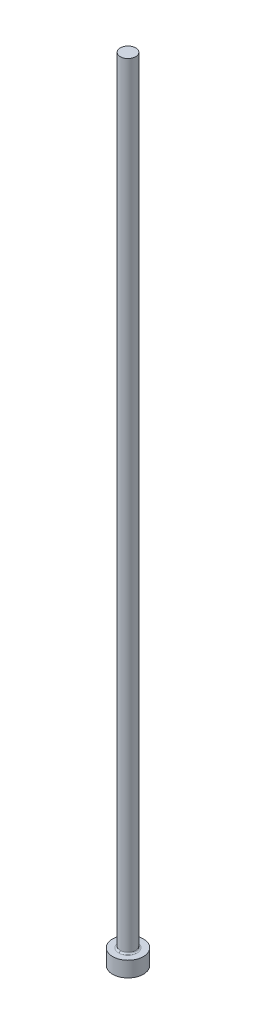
ISO-10303-21;
HEADER;
FILE_DESCRIPTION(('STEP AP214'),'2;1');
FILE_NAME('part.step','',(''),(''),'','','');
FILE_SCHEMA(('AUTOMOTIVE_DESIGN { 1 0 10303 214 1 1 1 1 }'));
ENDSEC;
DATA;
#1=APPLICATION_CONTEXT('core data for automotive mechanical design processes');
#2=APPLICATION_PROTOCOL_DEFINITION('international standard','automotive_design',2000,#1);
#3=PRODUCT_CONTEXT('',#1,'mechanical');
#4=PRODUCT('Part','Part','',(#3));
#5=PRODUCT_RELATED_PRODUCT_CATEGORY('part','',(#4));
#6=PRODUCT_DEFINITION_FORMATION('','',#4);
#7=PRODUCT_DEFINITION_CONTEXT('part definition',#1,'design');
#8=PRODUCT_DEFINITION('design','',#6,#7);
#9=PRODUCT_DEFINITION_SHAPE('','',#8);
#10=(LENGTH_UNIT() NAMED_UNIT(*) SI_UNIT(.MILLI.,.METRE.));
#11=(NAMED_UNIT(*) PLANE_ANGLE_UNIT() SI_UNIT($,.RADIAN.));
#12=(NAMED_UNIT(*) SI_UNIT($,.STERADIAN.) SOLID_ANGLE_UNIT());
#13=UNCERTAINTY_MEASURE_WITH_UNIT(LENGTH_MEASURE(1.E-05),#10,'distance_accuracy_value','');
#14=(GEOMETRIC_REPRESENTATION_CONTEXT(3) GLOBAL_UNCERTAINTY_ASSIGNED_CONTEXT((#13)) GLOBAL_UNIT_ASSIGNED_CONTEXT((#10,
#11,#12)) REPRESENTATION_CONTEXT('',''));
#15=CARTESIAN_POINT('',(0.,0.,0.));
#16=DIRECTION('',(0.,0.,1.));
#17=DIRECTION('',(1.,0.,0.));
#18=AXIS2_PLACEMENT_3D('',#15,#16,#17);
#19=CARTESIAN_POINT('',(-11.6785,-106.,107.776));
#20=DIRECTION('',(0.,-1.,0.));
#21=DIRECTION('',(0.,0.,1.));
#22=AXIS2_PLACEMENT_3D('',#19,#20,#21);
#23=PLANE('',#22);
#24=CARTESIAN_POINT('',(-13.7025,-106.,109.8));
#25=DIRECTION('',(0.,1.,0.));
#26=DIRECTION('',(-1.,0.,0.));
#27=AXIS2_PLACEMENT_3D('',#24,#25,#26);
#28=CIRCLE('',#27,2.);
#29=CARTESIAN_POINT('',(-15.7025,-106.,109.8));
#30=VERTEX_POINT('',#29);
#31=EDGE_CURVE('E45',#30,#30,#28,.F.);
#32=ORIENTED_EDGE('',*,*,#31,.T.);
#33=EDGE_LOOP('',(#32));
#34=FACE_BOUND('',#33,.T.);
#35=ADVANCED_FACE('F40',(#34),#23,.T.);
#36=CARTESIAN_POINT('',(-13.7025,-106.,109.8));
#37=DIRECTION('',(0.,1.,0.));
#38=DIRECTION('',(-1.,0.,0.));
#39=AXIS2_PLACEMENT_3D('',#36,#37,#38);
#40=CYLINDRICAL_SURFACE('',#39,2.);
#41=CARTESIAN_POINT('',(-13.7025,-104.,109.8));
#42=DIRECTION('',(0.,1.,0.));
#43=DIRECTION('',(-1.,0.,0.));
#44=AXIS2_PLACEMENT_3D('',#41,#42,#43);
#45=CIRCLE('',#44,2.);
#46=CARTESIAN_POINT('',(-15.7025,-104.,109.8));
#47=VERTEX_POINT('',#46);
#48=EDGE_CURVE('E81',#47,#47,#45,.T.);
#49=ORIENTED_EDGE('',*,*,#48,.F.);
#50=EDGE_LOOP('',(#49));
#51=FACE_BOUND('',#50,.T.);
#52=ORIENTED_EDGE('',*,*,#31,.F.);
#53=EDGE_LOOP('',(#52));
#54=FACE_BOUND('',#53,.T.);
#55=ADVANCED_FACE('F119',(#51,#54),#40,.T.);
#56=CARTESIAN_POINT('',(-13.7025,-103.999000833,108.580033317));
#57=CARTESIAN_POINT('',(-16.142433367,-103.999000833,108.580033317));
#58=CARTESIAN_POINT('',(-16.142433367,-103.999000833,111.019966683));
#59=CARTESIAN_POINT('',(-13.7025,-103.999000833,111.019966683));
#60=CARTESIAN_POINT('',(-13.7025,-104.012644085,108.716010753));
#61=CARTESIAN_POINT('',(-15.870478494,-104.012644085,108.716010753));
#62=CARTESIAN_POINT('',(-15.870478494,-104.012644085,110.883989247));
#63=CARTESIAN_POINT('',(-13.7025,-104.012644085,110.883989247));
#64=CARTESIAN_POINT('',(-13.7025,-103.916010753,108.812644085));
#65=CARTESIAN_POINT('',(-15.677211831,-103.916010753,108.812644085));
#66=CARTESIAN_POINT('',(-15.677211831,-103.916010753,110.787355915));
#67=CARTESIAN_POINT('',(-13.7025,-103.916010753,110.787355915));
#68=CARTESIAN_POINT('',(-13.7025,-103.780033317,108.799000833));
#69=CARTESIAN_POINT('',(-15.704498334,-103.780033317,108.799000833));
#70=CARTESIAN_POINT('',(-15.704498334,-103.780033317,110.800999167));
#71=CARTESIAN_POINT('',(-13.7025,-103.780033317,110.800999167));
#72=(BOUNDED_SURFACE() B_SPLINE_SURFACE(3,3,((#56,#57,#58,#59),(#60,#61,#62,#63),(#64,#65,#66,
#67),(#68,#69,#70,#71)),.UNSPECIFIED.,.F.,.F.,.F.) B_SPLINE_SURFACE_WITH_KNOTS((4,4),(4,4),(0.,
1.),(0.,1.),.UNSPECIFIED.) GEOMETRIC_REPRESENTATION_ITEM() RATIONAL_B_SPLINE_SURFACE(((1.,
0.333333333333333,0.333333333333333,1.),(0.755320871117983,0.251773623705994,0.251773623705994,
0.755320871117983),(0.755320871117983,0.251773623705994,0.251773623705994,0.755320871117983),
(1.,0.333333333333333,0.333333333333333,1.))) REPRESENTATION_ITEM('') SURFACE());
#73=CARTESIAN_POINT('',(-13.7025,-103.8,109.8));
#74=DIRECTION('',(0.,1.,0.));
#75=DIRECTION('',(0.,0.,-1.));
#76=AXIS2_PLACEMENT_3D('',#73,#74,#75);
#77=CIRCLE('',#76,1.);
#78=CARTESIAN_POINT('',(-13.7024999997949,-103.800000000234,110.799999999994));
#79=VERTEX_POINT('',#78);
#80=CARTESIAN_POINT('',(-13.7024999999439,-103.80000000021,108.800000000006));
#81=VERTEX_POINT('',#80);
#82=EDGE_CURVE('E75',#79,#81,#77,.F.);
#83=CARTESIAN_POINT('',(-13.7025,-103.999000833,108.580033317));
#84=CARTESIAN_POINT('',(-13.7025,-104.012644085,108.716010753));
#85=CARTESIAN_POINT('',(-13.7025,-103.916010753,108.812644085));
#86=CARTESIAN_POINT('',(-13.7025,-103.780033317,108.799000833));
#87=(BOUNDED_CURVE() B_SPLINE_CURVE(3,(#83,#84,#85,#86),.UNSPECIFIED.,.F.,
.F.) B_SPLINE_CURVE_WITH_KNOTS((4,4),(0.,1.),
.UNSPECIFIED.) CURVE() GEOMETRIC_REPRESENTATION_ITEM() RATIONAL_B_SPLINE_CURVE((1.,
0.755320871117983,0.755320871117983,1.)) REPRESENTATION_ITEM(''));
#88=CARTESIAN_POINT('',(-13.7025,-104.000000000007,108.599999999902));
#89=VERTEX_POINT('',#88);
#90=EDGE_CURVE('E69',#89,#81,#87,.T.);
#91=CARTESIAN_POINT('',(-13.7025,-104.000000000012,108.600000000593));
#92=CARTESIAN_POINT('',(-16.1024999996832,-104.000000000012,108.600000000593));
#93=CARTESIAN_POINT('',(-16.1024999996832,-104.000000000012,110.999999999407));
#94=CARTESIAN_POINT('',(-13.7025,-104.000000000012,110.999999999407));
#95=(BOUNDED_CURVE() B_SPLINE_CURVE(3,(#91,#92,#93,#94),.UNSPECIFIED.,.F.,
.F.) B_SPLINE_CURVE_WITH_KNOTS((4,4),(0.,1.),
.UNSPECIFIED.) CURVE() GEOMETRIC_REPRESENTATION_ITEM() RATIONAL_B_SPLINE_CURVE((0.956578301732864,
0.318859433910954,0.318859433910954,0.956578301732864)) REPRESENTATION_ITEM(''));
#96=CARTESIAN_POINT('',(-13.7025,-104.000000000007,111.000000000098));
#97=VERTEX_POINT('',#96);
#98=EDGE_CURVE('E72',#97,#89,#95,.F.);
#99=CARTESIAN_POINT('',(-13.7025,-103.999000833,111.019966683));
#100=CARTESIAN_POINT('',(-13.7025,-104.012644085,110.883989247));
#101=CARTESIAN_POINT('',(-13.7025,-103.916010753,110.787355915));
#102=CARTESIAN_POINT('',(-13.7025,-103.780033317,110.800999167));
#103=(BOUNDED_CURVE() B_SPLINE_CURVE(3,(#99,#100,#101,#102),.UNSPECIFIED.,.F.,
.F.) B_SPLINE_CURVE_WITH_KNOTS((4,4),(0.,1.),
.UNSPECIFIED.) CURVE() GEOMETRIC_REPRESENTATION_ITEM() RATIONAL_B_SPLINE_CURVE((1.,
0.755320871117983,0.755320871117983,1.)) REPRESENTATION_ITEM(''));
#104=EDGE_CURVE('E60',#79,#97,#103,.F.);
#105=ORIENTED_EDGE('',*,*,#82,.T.);
#106=ORIENTED_EDGE('',*,*,#90,.F.);
#107=ORIENTED_EDGE('',*,*,#98,.F.);
#108=ORIENTED_EDGE('',*,*,#104,.F.);
#109=EDGE_LOOP('',(#105,#106,#107,#108));
#110=FACE_BOUND('',#109,.T.);
#111=ADVANCED_FACE('F71',(#110),#72,.F.);
#112=CARTESIAN_POINT('',(-11.6785,-104.,111.824));
#113=DIRECTION('',(0.,1.,0.));
#114=DIRECTION('',(0.,0.,-1.));
#115=AXIS2_PLACEMENT_3D('',#112,#113,#114);
#116=PLANE('',#115);
#117=CARTESIAN_POINT('',(-13.7025,-104.000000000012,110.999999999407));
#118=CARTESIAN_POINT('',(-11.3025000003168,-104.000000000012,110.999999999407));
#119=CARTESIAN_POINT('',(-11.3025000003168,-104.000000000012,108.600000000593));
#120=CARTESIAN_POINT('',(-13.7025,-104.000000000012,108.600000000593));
#121=(BOUNDED_CURVE() B_SPLINE_CURVE(3,(#117,#118,#119,#120),.UNSPECIFIED.,.F.,
.F.) B_SPLINE_CURVE_WITH_KNOTS((4,4),(0.,1.),
.UNSPECIFIED.) CURVE() GEOMETRIC_REPRESENTATION_ITEM() RATIONAL_B_SPLINE_CURVE((0.95657830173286,
0.318859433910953,0.318859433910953,0.95657830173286)) REPRESENTATION_ITEM(''));
#122=EDGE_CURVE('E51',#89,#97,#121,.F.);
#123=ORIENTED_EDGE('',*,*,#122,.T.);
#124=ORIENTED_EDGE('',*,*,#98,.T.);
#125=EDGE_LOOP('',(#123,#124));
#126=FACE_BOUND('',#125,.T.);
#127=ORIENTED_EDGE('',*,*,#48,.T.);
#128=EDGE_LOOP('',(#127));
#129=FACE_BOUND('',#128,.T.);
#130=ADVANCED_FACE('F42',(#126,#129),#116,.T.);
#131=CARTESIAN_POINT('',(-13.7025,-103.8,109.8));
#132=DIRECTION('',(0.,1.,0.));
#133=DIRECTION('',(0.,0.,1.));
#134=AXIS2_PLACEMENT_3D('',#131,#132,#133);
#135=CYLINDRICAL_SURFACE('',#134,1.);
#136=CARTESIAN_POINT('',(-13.7025,-103.800000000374,109.8));
#137=DIRECTION('',(0.,1.,0.));
#138=DIRECTION('',(0.,0.,1.));
#139=AXIS2_PLACEMENT_3D('',#136,#137,#138);
#140=CIRCLE('',#139,0.999999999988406);
#141=EDGE_CURVE('E13',#79,#81,#140,.T.);
#142=ORIENTED_EDGE('',*,*,#141,.T.);
#143=ORIENTED_EDGE('',*,*,#82,.F.);
#144=EDGE_LOOP('',(#142,#143));
#145=FACE_BOUND('',#144,.T.);
#146=CARTESIAN_POINT('',(-13.7025,-3.0475,109.8));
#147=DIRECTION('',(0.,1.,0.));
#148=DIRECTION('',(0.,0.,1.));
#149=AXIS2_PLACEMENT_3D('',#146,#147,#148);
#150=CIRCLE('',#149,1.);
#151=CARTESIAN_POINT('',(-13.7025,-3.0475,110.8));
#152=VERTEX_POINT('',#151);
#153=EDGE_CURVE('E88',#152,#152,#150,.T.);
#154=ORIENTED_EDGE('',*,*,#153,.F.);
#155=EDGE_LOOP('',(#154));
#156=FACE_BOUND('',#155,.T.);
#157=ADVANCED_FACE('F105',(#145,#156),#135,.T.);
#158=CARTESIAN_POINT('',(-13.7025,-103.999000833,111.019966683));
#159=CARTESIAN_POINT('',(-11.262566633,-103.999000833,111.019966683));
#160=CARTESIAN_POINT('',(-11.262566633,-103.999000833,108.580033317));
#161=CARTESIAN_POINT('',(-13.7025,-103.999000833,108.580033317));
#162=CARTESIAN_POINT('',(-13.7025,-104.012644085,110.883989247));
#163=CARTESIAN_POINT('',(-11.534521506,-104.012644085,110.883989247));
#164=CARTESIAN_POINT('',(-11.534521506,-104.012644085,108.716010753));
#165=CARTESIAN_POINT('',(-13.7025,-104.012644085,108.716010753));
#166=CARTESIAN_POINT('',(-13.7025,-103.916010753,110.787355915));
#167=CARTESIAN_POINT('',(-11.727788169,-103.916010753,110.787355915));
#168=CARTESIAN_POINT('',(-11.727788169,-103.916010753,108.812644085));
#169=CARTESIAN_POINT('',(-13.7025,-103.916010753,108.812644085));
#170=CARTESIAN_POINT('',(-13.7025,-103.780033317,110.800999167));
#171=CARTESIAN_POINT('',(-11.700501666,-103.780033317,110.800999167));
#172=CARTESIAN_POINT('',(-11.700501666,-103.780033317,108.799000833));
#173=CARTESIAN_POINT('',(-13.7025,-103.780033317,108.799000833));
#174=(BOUNDED_SURFACE() B_SPLINE_SURFACE(3,3,((#158,#159,#160,#161),(#162,#163,#164,#165),(#166,
#167,#168,#169),(#170,#171,#172,#173)),.UNSPECIFIED.,.F.,.F.,
.F.) B_SPLINE_SURFACE_WITH_KNOTS((4,4),(4,4),(0.,1.),(0.,1.),
.UNSPECIFIED.) GEOMETRIC_REPRESENTATION_ITEM() RATIONAL_B_SPLINE_SURFACE(((1.,0.333333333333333,
0.333333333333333,1.),(0.755320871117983,0.251773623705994,0.251773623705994,0.755320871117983),
(0.755320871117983,0.251773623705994,0.251773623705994,0.755320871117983),(1.,0.333333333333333,
0.333333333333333,1.))) REPRESENTATION_ITEM('') SURFACE());
#175=ORIENTED_EDGE('',*,*,#104,.T.);
#176=ORIENTED_EDGE('',*,*,#122,.F.);
#177=ORIENTED_EDGE('',*,*,#90,.T.);
#178=ORIENTED_EDGE('',*,*,#141,.F.);
#179=EDGE_LOOP('',(#175,#176,#177,#178));
#180=FACE_BOUND('',#179,.T.);
#181=ADVANCED_FACE('F85',(#180),#174,.F.);
#182=CARTESIAN_POINT('',(-13.7025,-3.0475,109.8));
#183=DIRECTION('',(0.,1.,0.));
#184=DIRECTION('',(0.,0.,1.));
#185=AXIS2_PLACEMENT_3D('',#182,#183,#184);
#186=PLANE('',#185);
#187=ORIENTED_EDGE('',*,*,#153,.T.);
#188=EDGE_LOOP('',(#187));
#189=FACE_BOUND('',#188,.T.);
#190=ADVANCED_FACE('F104',(#189),#186,.T.);
#191=CLOSED_SHELL('',(#35,#55,#111,#130,#157,#181,#190));
#192=MANIFOLD_SOLID_BREP('B2',#191);
#193=ADVANCED_BREP_SHAPE_REPRESENTATION('',(#18,#192),#14);
#194=SHAPE_DEFINITION_REPRESENTATION(#9,#193);
ENDSEC;
END-ISO-10303-21;
